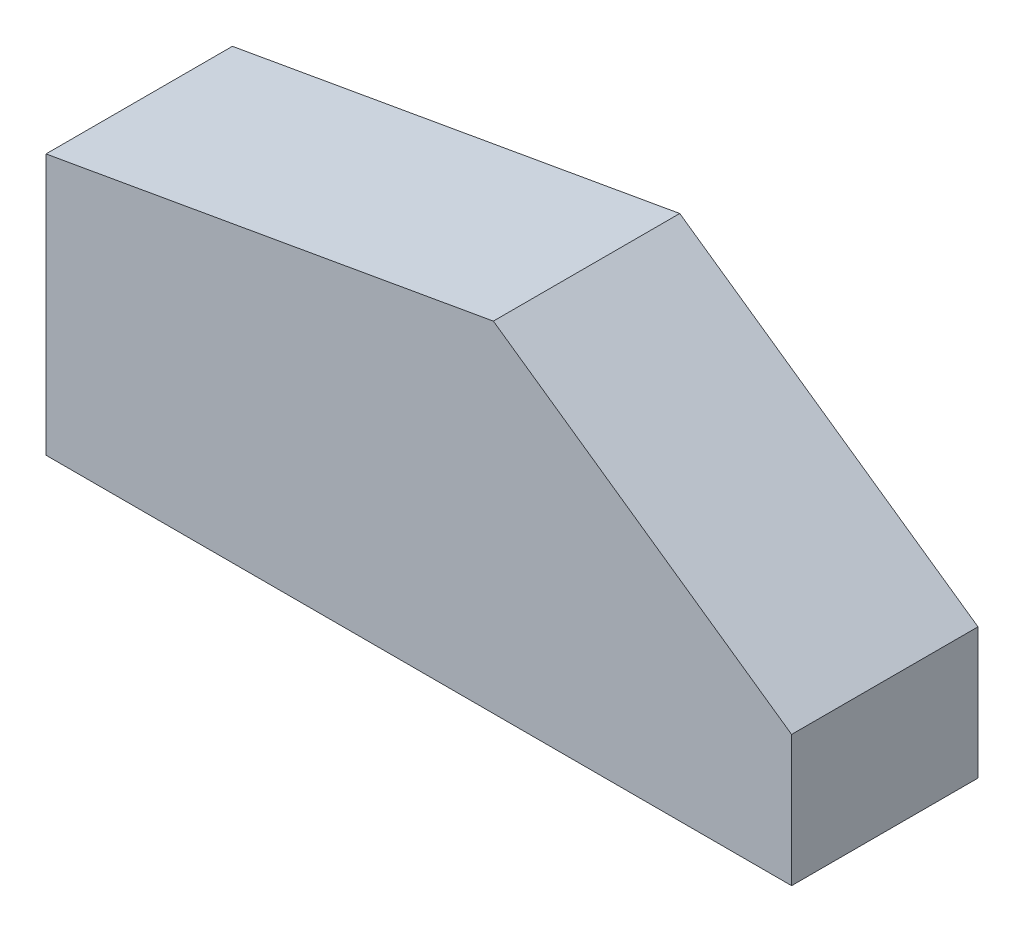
from build123d import *

# Parameters (mm, degrees)
BOSS_EXTRUDE1_DEPTH = 25


with BuildPart() as part:
    # Sketch1 → Boss-Extrude1 (new body)
    with BuildSketch(Plane.XY):
        Polygon((60, 45.579618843), (100, 17.571317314), (100, 0), (0, 0), (0, 35), align=None)
    extrude(amount=BOSS_EXTRUDE1_DEPTH)


solid = part.part
